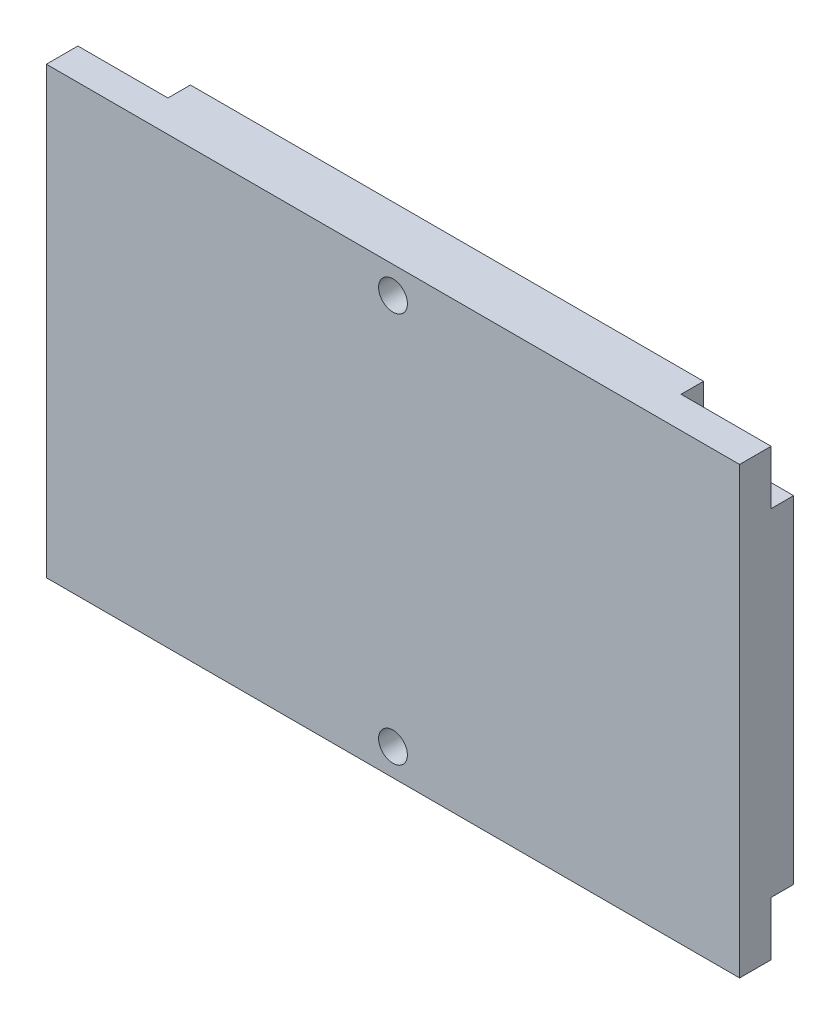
from build123d import *

# Parameters (mm, degrees)
ESQUISSE1_R        = 1.6
BOSS_EXTRU_1_DEPTH = 6
ESQUISSE2_W        = 13.29072726
ESQUISSE2_H        = 10.244942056
ESQUISSE2_W_2      = 14.42274987
ESQUISSE2_H_2      = 11.028650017
ESQUISSE2_W_3      = 16.425559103
ESQUISSE2_H_3      = 12.683144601
ESQUISSE2_W_4      = 15.903087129
ESQUISSE2_H_4      = 15.730897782
BOSS_EXTRU_2_DEPTH = 3.5


with BuildPart() as part:
    # Esquisse1 → Boss.-Extru.1 (new body)
    with BuildSketch(Plane.XY):
        with BuildLine():
            Line((-28.5, 24.7), (28.5, 24.7))
            Line((28.5, 24.7), (28.5, 20.961895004))
            ThreePointArc((28.5, 20.961895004), (28.46862915, 18.66862915), (30.761895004, 18.7))
            Line((30.761895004, 18.7), (38.5, 18.7))
            Line((38.5, 18.7), (38.5, -18.7))
            Line((38.5, -18.7), (30.761895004, -18.7))
            ThreePointArc((30.761895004, -18.7), (28.46862915, -18.66862915), (28.5, -20.961895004))
            Line((28.5, -20.961895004), (28.5, -24.7))
            Line((28.5, -24.7), (-28.5, -24.7))
            Line((-28.5, -24.7), (-28.5, -20.961895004))
            ThreePointArc((-28.5, -20.961895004), (-28.46862915, -18.66862915), (-30.761895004, -18.7))
            Line((-30.761895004, -18.7), (-38.5, -18.7))
            Line((-38.5, -18.7), (-38.5, 18.7))
            Line((-38.5, 18.7), (-30.761895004, 18.7))
            ThreePointArc((-30.761895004, 18.7), (-28.46862915, 18.66862915), (-28.5, 20.961895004))
            Line((-28.5, 20.961895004), (-28.5, 24.7))
        make_face()
        with Locations((0, 21.7)):
            Circle(ESQUISSE1_R, mode=Mode.SUBTRACT)
        with Locations(Location((0, -21.7, 0), (0, 0, 180))):
            Circle(ESQUISSE1_R, mode=Mode.SUBTRACT)
    extrude(amount=BOSS_EXTRU_1_DEPTH)

    # Esquisse2 → Boss.-Extru.2 (add)
    with BuildSketch(Plane.XY.offset(6)):
        with Locations((-31.85463637, 19.577528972)):
            Rectangle(ESQUISSE2_W, ESQUISSE2_H)
        with Locations((-31.288625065, -19.185674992)):
            Rectangle(ESQUISSE2_W_2, ESQUISSE2_H_2)
        with Locations((30.287220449, 18.3584277)):
            Rectangle(ESQUISSE2_W_3, ESQUISSE2_H_3)
        with Locations((30.548456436, -16.834551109)):
            Rectangle(ESQUISSE2_W_4, ESQUISSE2_H_4)
    extrude(amount=-BOSS_EXTRU_2_DEPTH)


solid = part.part
